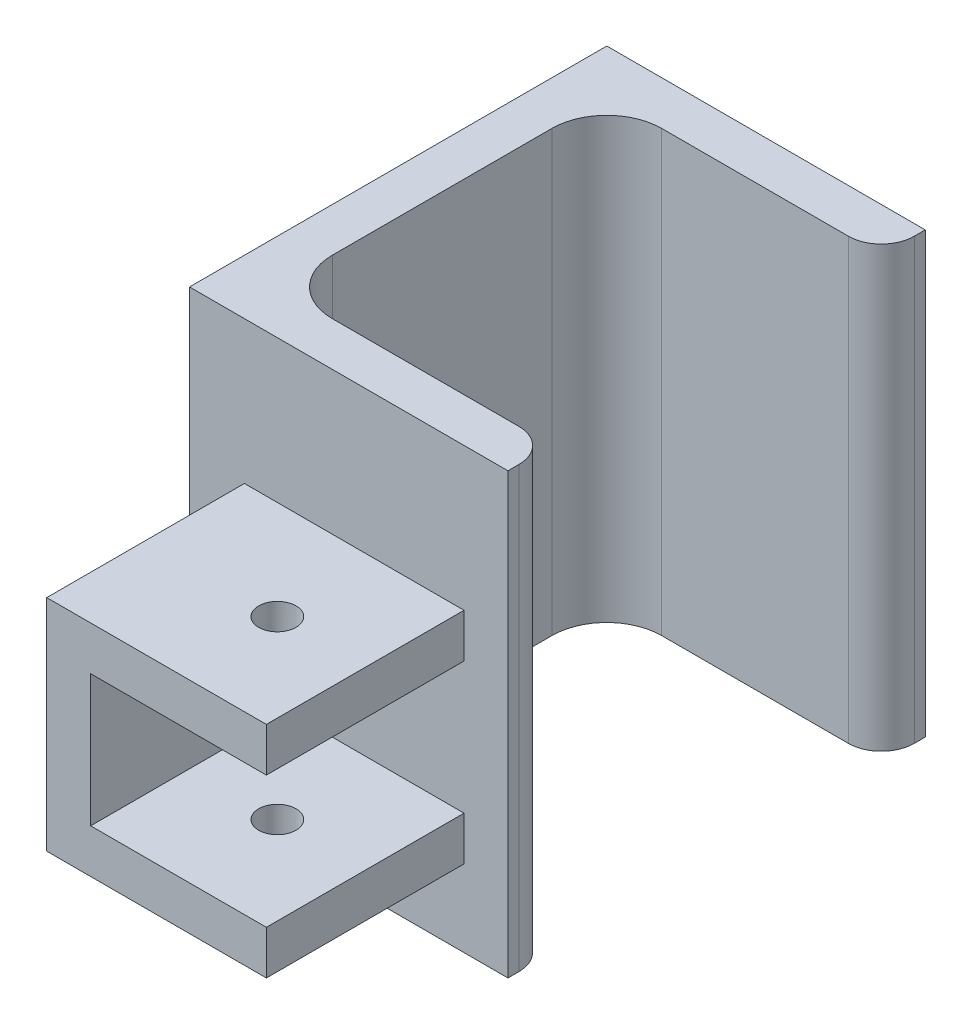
from build123d import *

# Parameters (mm, degrees)
SKETCH4_W           = 30
SKETCH4_H           = 40
BOSS_EXTRUDE2_DEPTH = 4
SKETCH5_W           = 29
SKETCH5_H           = 40
BOSS_EXTRUDE3_DEPTH = 4
SKETCH6_W           = 29
SKETCH6_H           = 40
BOSS_EXTRUDE4_DEPTH = 4
FILLET1_R           = 5
FILLET2_R           = 3
SKETCH8_W           = 20
SKETCH8_H           = 20
BOSS_EXTRUDE5_DEPTH = 18
SKETCH9_W           = 16
SKETCH9_H           = 12
CUT_EXTRUDE1_DEPTH  = 18
SKETCH10_R          = 1.7
CUT_EXTRUDE2_DEPTH  = 58.436921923


with BuildPart() as part:
    # Sketch4 → Boss-Extrude2 (new body)
    with BuildSketch(Plane(origin=(0, 0, 0), x_dir=(0, 0, -1), z_dir=(1, 0, 0))):
        Rectangle(SKETCH4_W, SKETCH4_H)
    extrude(amount=BOSS_EXTRUDE2_DEPTH)

    # Sketch5 → Boss-Extrude3 (add)
    with BuildSketch(Plane.XY.offset(15)):
        with Locations((14.5, 0)):
            Rectangle(SKETCH5_W, SKETCH5_H)
    extrude(amount=BOSS_EXTRUDE3_DEPTH)

    # Sketch6 → Boss-Extrude4 (add)
    with BuildSketch(Plane(origin=(0, 0, -15), x_dir=(-1, 0, 0), z_dir=(0, 0, -1))):
        with Locations((-14.5, 0)):
            Rectangle(SKETCH6_W, SKETCH6_H)
    extrude(amount=BOSS_EXTRUDE4_DEPTH)

    # Fillet1
    fillet1_edges = [part.edges().sort_by_distance(p)[0] for p in [
        (4, 0, 15),
        (4, 0, -15),
    ]]
    fillet(fillet1_edges, radius=FILLET1_R)

    # Fillet2
    fillet2_edges = [part.edges().sort_by_distance(p)[0] for p in [
        (29, 0, 15),
        (29, 0, -15),
    ]]
    fillet(fillet2_edges, radius=FILLET2_R)

    # Sketch8 → Boss-Extrude5 (add)
    with BuildSketch(Plane.XY.offset(19)):
        with Locations((15, -3)):
            Rectangle(SKETCH8_W, SKETCH8_H)
    extrude(amount=BOSS_EXTRUDE5_DEPTH)

    # Sketch9 → Cut-Extrude1 (cut)
    with BuildSketch(Plane.XY.offset(37)):
        with Locations((17, -3)):
            Rectangle(SKETCH9_W, SKETCH9_H)
    extrude(amount=-CUT_EXTRUDE1_DEPTH, mode=Mode.SUBTRACT)

    # Sketch10 → Cut-Extrude2 (cut, through all)
    with BuildSketch(Plane.XZ.offset(13)):
        with Locations(Location((17, 28, 0), (0, 0, 270))):
            Circle(SKETCH10_R)
    extrude(amount=-CUT_EXTRUDE2_DEPTH, mode=Mode.SUBTRACT)


solid = part.part
